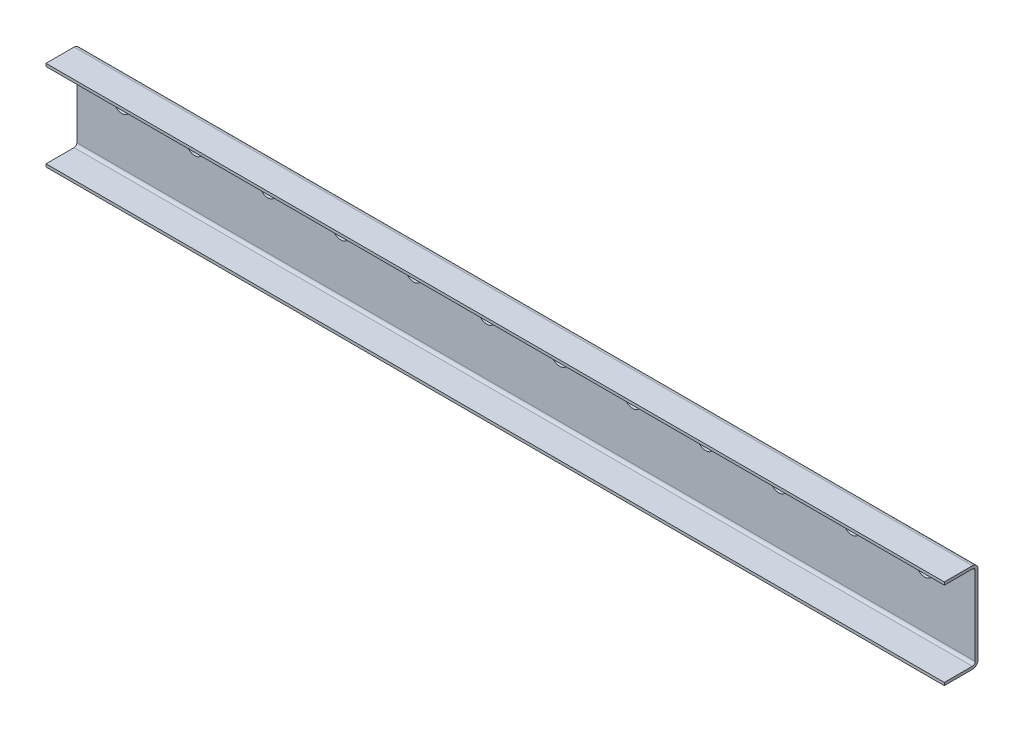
from build123d import *

# Parameters (mm, degrees)
BASE_EXTRUDE_THIN_DEPTH = 1016
FILLET2_R               = 3.175
FILLET1_R               = 6.35
SKETCH2_R               = 9.525
CUT_EXTRUDE1_DEPTH      = 1022.777945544
LPATTERN1_COUNT         = 12
LPATTERN1_PITCH         = 82.55


with BuildPart() as part:
    # Sketch1 → Base-Extrude-Thin (new body)
    with BuildSketch(Plane(origin=(0, 0, 0), x_dir=(0, 0, -1), z_dir=(1, 0, 0))):
        Polygon((-38.1, 0), (0, 0), (0, -101.6), (-38.1, -101.6), (-38.1, -98.425), (-3.175, -98.425), (-3.175, -3.175), (-38.1, -3.175), align=None)
    extrude(amount=BASE_EXTRUDE_THIN_DEPTH)

    # Fillet2
    fillet2_edges = [part.edges().sort_by_distance(p)[0] for p in [
        (508, -3.175, 3.175),
        (508, -98.425, 3.175),
    ]]
    fillet(fillet2_edges, radius=FILLET2_R)

    # Fillet1
    fillet1_edges = [part.edges().sort_by_distance(p)[0] for p in [
        (508, -101.6, 0),
        (508, 0, 0),
    ]]
    fillet(fillet1_edges, radius=FILLET1_R)

    # Sketch2 → Cut-Extrude1 (cut, through all)
    with BuildSketch(Plane(origin=(0, 0, 0), x_dir=(-1, 0, 0), z_dir=(0, 0, -1))):
        with Locations(Location((-50.8, -31.75, 0), (0, 0, 90))):
            Circle(SKETCH2_R)
    cut_extrude1 = extrude(amount=-CUT_EXTRUDE1_DEPTH, mode=Mode.SUBTRACT)

    # LPattern1: Cut-Extrude1 ×12
    with Locations(*[(i * LPATTERN1_PITCH, 0, 0) for i in range(1, LPATTERN1_COUNT)]):
        add(cut_extrude1, mode=Mode.SUBTRACT)


solid = part.part
